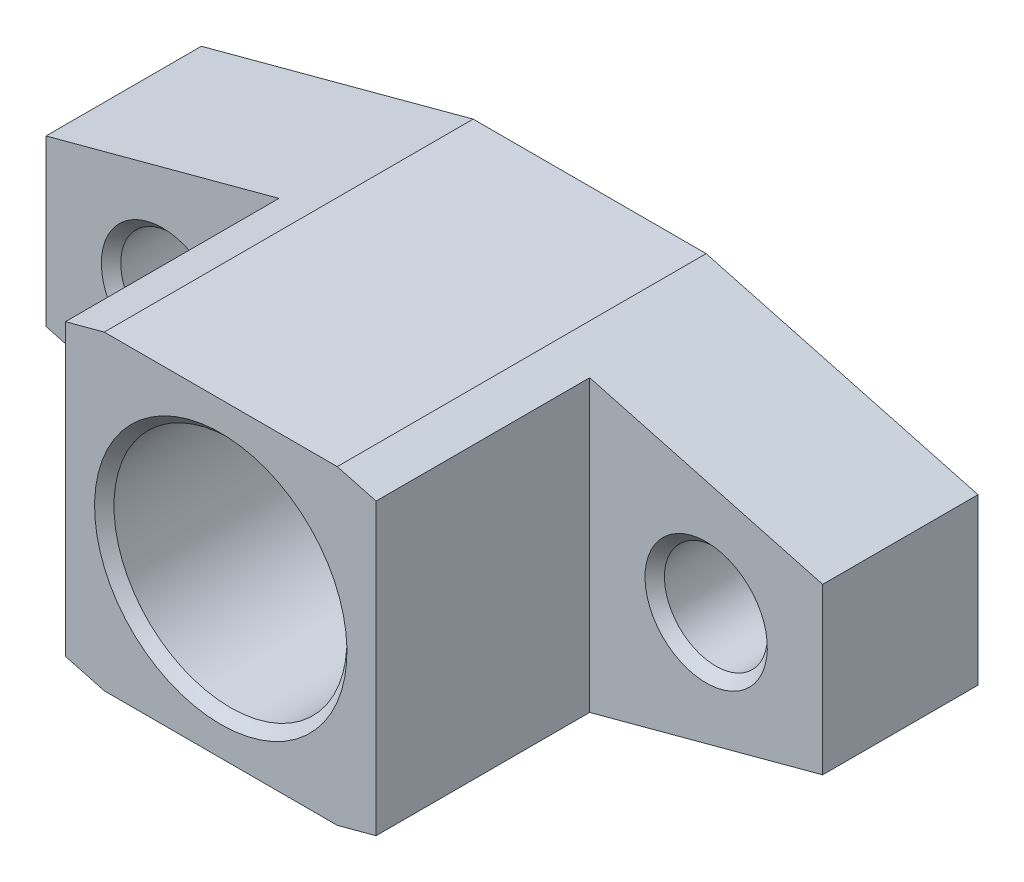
from build123d import *

# Parameters (mm, degrees)
SKETCH_1_R          = 2.65
EXTRUDE_1_DEPTH     = 8
EXTRUDE_2_DEPTH     = 19
SKETCH_4_R          = 6
CUT_EXTRUDE_1_DEPTH = 29.722813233
CHAMFER_1_SIZE      = 0.5
CHAMFER_3_SIZE      = 0.5
MOVE_BODY_2_ANGLE   = 90


with BuildPart() as part:
    # Sketch 1 → Extrude 1 (new body)
    with BuildSketch(Plane(origin=(0, 0, 0), x_dir=(1, 0, 0), z_dir=(0, 1, 0))):
        Polygon((-6, 8), (6, 8), (20, 4.248711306), (20, -4.248711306), (6, -8), (-6, -8), (-20, -4.248711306), (-20, 4.248711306), align=None)
        with Locations(Location((14, 0, 0), (0, 0, 270))):
            Circle(SKETCH_1_R, mode=Mode.SUBTRACT)
        with Locations(Location((-14, 0, 0), (0, 0, 90))):
            Circle(SKETCH_1_R, mode=Mode.SUBTRACT)
    extrude(amount=EXTRUDE_1_DEPTH)

    # Sketch 3 → Extrude 2 (add)
    with BuildSketch(Plane(origin=(0, 0, 0), x_dir=(1, 0, 0), z_dir=(0, 1, 0))):
        Polygon((6, -8), (-6, -8), (-8, -7.464101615), (-8, 7.464101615), (-6, 8), (6, 8), (8, 7.464101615), (8, -7.464101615), align=None)
    extrude(amount=EXTRUDE_2_DEPTH)

    # Sketch 4 → Cut-Extrude 1 (cut, through all)
    with BuildSketch(Plane.XZ):
        with Locations(Location((0, 0, 0), (0, 0, 270))):
            Circle(SKETCH_4_R)
    extrude(amount=-CUT_EXTRUDE_1_DEPTH, mode=Mode.SUBTRACT)

    # Chamfer 1
    chamfer_1_edges = [part.edges().sort_by_distance(p)[0] for p in [
        (0, 19, 6),
    ]]
    chamfer(chamfer_1_edges, length=CHAMFER_1_SIZE)

    # Chamfer 3
    chamfer_3_edges = [part.edges().sort_by_distance(p)[0] for p in [
        (14, 0, -2.65),
        (14, 8, -2.65),
        (-14, 0, 2.65),
        (-14, 8, 2.65),
        (0, 0, 6),
    ]]
    chamfer(chamfer_3_edges, length=CHAMFER_3_SIZE)


with BuildPart() as part_1:
    # Move Body 1: moved
    add(part.part.moved(Location((14, 0, 0))))


with BuildPart() as part_2:
    # Move Body 2: moved
    add(part_1.part.rotate(Axis((0, 0, 0), (1, 0, 0)), MOVE_BODY_2_ANGLE))


solid = part_2.part
